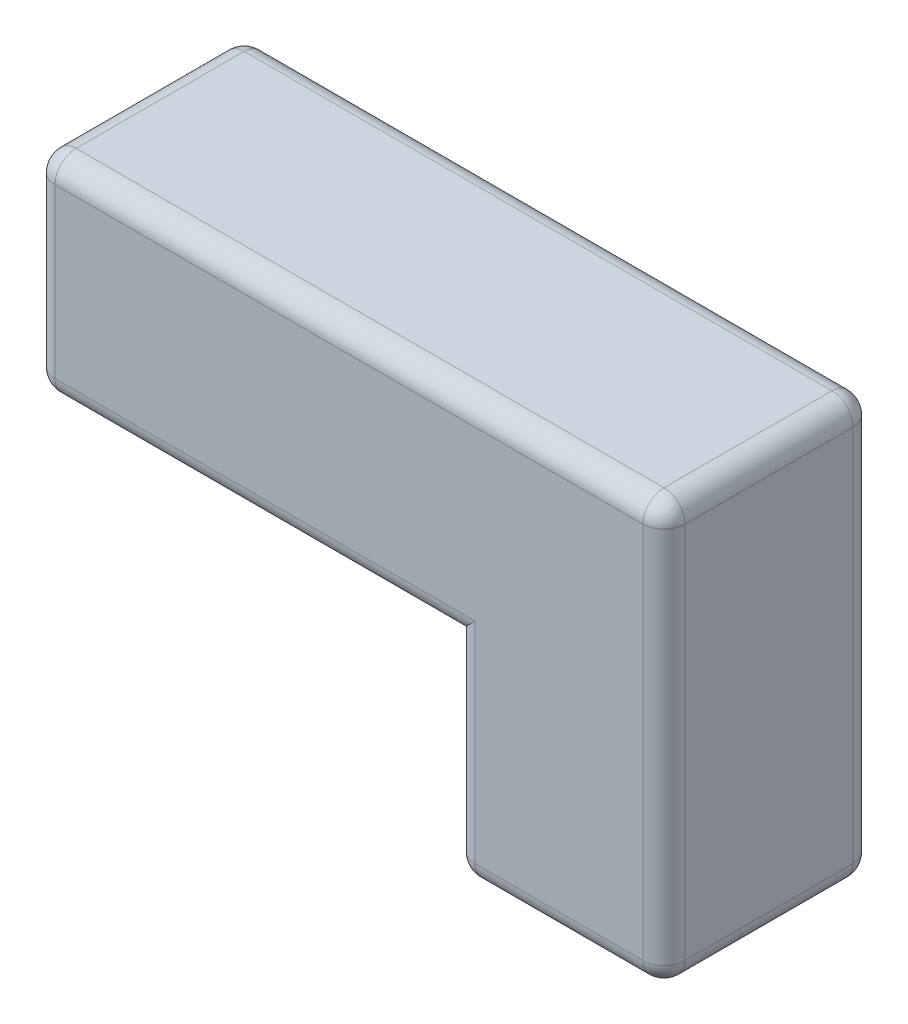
from build123d import *

# Parameters (mm, degrees)
BOSS_EXTRUDE1_DEPTH = 100
FILLET2_R           = 10


with BuildPart() as part:
    # Sketch1 → Boss-Extrude1 (new body)
    with BuildSketch(Plane.XY):
        Polygon((-326.4, 114.740311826), (-26.4, 114.740311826), (-26.4, 14.740311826), (-26.4, -85.259688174), (-126.4, -85.259688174), (-126.4, 14.740311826), (-326.4, 14.740311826), align=None)
    extrude(amount=BOSS_EXTRUDE1_DEPTH)

    # Fillet2
    fillet2_edges = [part.edges().sort_by_distance(p)[0] for p in [
        (-126.4, -35.259688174, 100),
        (-326.4, 114.740311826, 50),
        (-26.4, 114.740311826, 50),
        (-26.4, -85.259688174, 50),
        (-126.4, -85.259688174, 50),
        (-326.4, 14.740311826, 50),
        (-76.4, -85.259688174, 100),
        (-26.4, 14.740311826, 100),
        (-176.4, 114.740311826, 100),
        (-326.4, 64.740311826, 100),
        (-176.4, 114.740311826, 0),
        (-226.4, 14.740311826, 100),
        (-26.4, 14.740311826, 0),
        (-76.4, -85.259688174, 0),
        (-126.4, -35.259688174, 0),
        (-226.4, 14.740311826, 0),
        (-326.4, 64.740311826, 0),
    ]]
    fillet(fillet2_edges, radius=FILLET2_R)


solid = part.part
